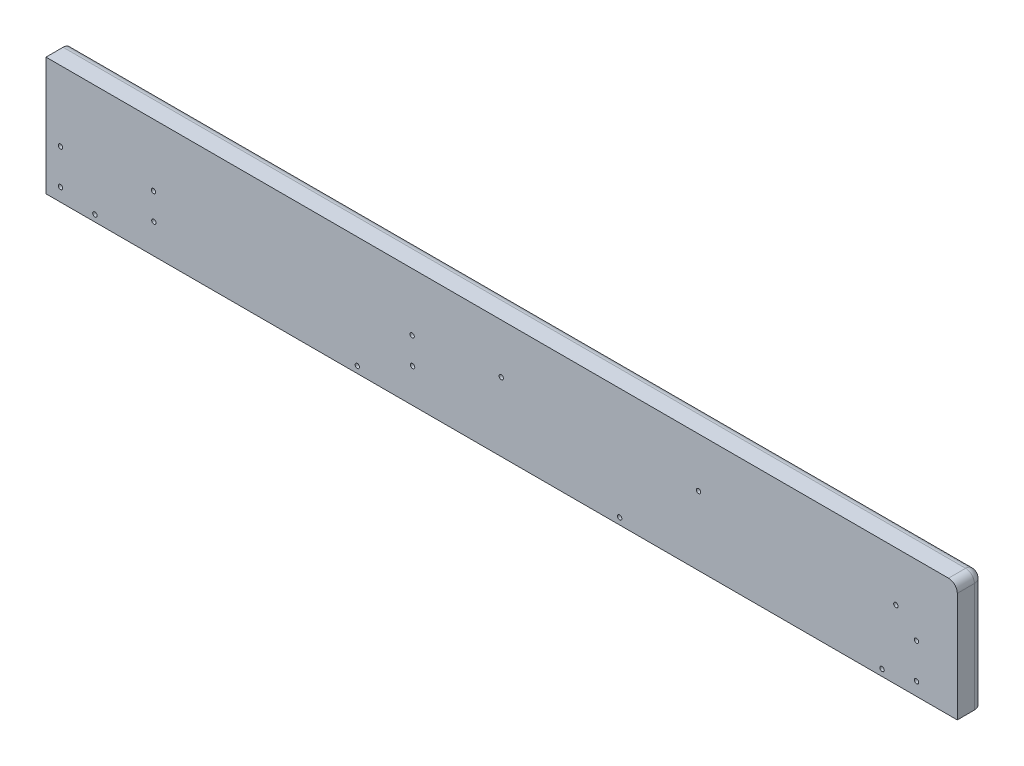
from build123d import *

# Parameters (mm, degrees)
SKETCH_1_W          = 2018
SKETCH_1_H          = 270
SKETCH_1_R          = 5
EXTRUDE_1_DEPTH     = 16
SKETCH_2_R          = 5
CUT_EXTRUDE_1_DEPTH = 1045.622898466
SKETCH_3_W          = 2018
SKETCH_3_H          = 270
EXTRUDE_2_DEPTH     = 43
FILLET_1_R          = 20
MOVE_FACE_2_BY      = 60
FILLET_2_R          = 20


with BuildPart() as part:
    # Sketch 1 → Extrude 1 (new body)
    with BuildSketch(Plane.XY):
        with Locations((0, -135)):
            Rectangle(SKETCH_1_W, SKETCH_1_H)
        with Locations((929, -113)):
            Circle(SKETCH_1_R, mode=Mode.SUBTRACT)
        with Locations((29, -113)):
            Circle(SKETCH_1_R, mode=Mode.SUBTRACT)
        with Locations((479, -113)):
            Circle(SKETCH_1_R, mode=Mode.SUBTRACT)
        with Locations((976, -160)):
            Circle(SKETCH_1_R, mode=Mode.SUBTRACT)
        with Locations((976, -240)):
            Circle(SKETCH_1_R, mode=Mode.SUBTRACT)
        with Locations((-976, -240)):
            Circle(SKETCH_1_R, mode=Mode.SUBTRACT)
        with Locations((-976, -160)):
            Circle(SKETCH_1_R, mode=Mode.SUBTRACT)
        with Locations((-897.5, -255)):
            Circle(SKETCH_1_R, mode=Mode.SUBTRACT)
        with Locations((-299.166666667, -255)):
            Circle(SKETCH_1_R, mode=Mode.SUBTRACT)
        with Locations((299.166666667, -255)):
            Circle(SKETCH_1_R, mode=Mode.SUBTRACT)
        with Locations((897.5, -255)):
            Circle(SKETCH_1_R, mode=Mode.SUBTRACT)
    extrude(amount=EXTRUDE_1_DEPTH)

    # Sketch 2 → Cut-Extrude 1 (cut, through all)
    with BuildSketch(Plane(origin=(0, 0, 0), x_dir=(-1, 0, 0), z_dir=(0, 0, -1))):
        with Locations((173.067802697, -191.991381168)):
            Circle(SKETCH_2_R)
        with Locations((174.08475185, -132)):
            Circle(SKETCH_2_R)
        with Locations((764, -142)):
            Circle(SKETCH_2_R)
        with Locations((762.983050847, -201.991381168)):
            Circle(SKETCH_2_R)
    extrude(amount=-CUT_EXTRUDE_1_DEPTH, mode=Mode.SUBTRACT)

    # Sketch 3 → Extrude 2 (add)
    with BuildSketch(Plane(origin=(0, 0, 0), x_dir=(-1, 0, 0), z_dir=(0, 0, -1))):
        with Locations((0, -135)):
            Rectangle(SKETCH_3_W, SKETCH_3_H)
    extrude(amount=EXTRUDE_2_DEPTH)

    # Fillet 1
    fillet_1_edges = [part.edges().sort_by_distance(p)[0] for p in [
        (0, 0, -43),
    ]]
    fillet(fillet_1_edges, radius=FILLET_1_R)

    # Move Face 2: a face moved outward by 60.0
    extrude(part.faces().sort_by_distance((1009, -135.707201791, -13.364377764))[0], amount=MOVE_FACE_2_BY, dir=(1, 0, 0))

    # Fillet 2
    fillet_2_edges = [part.edges().sort_by_distance(p)[0] for p in [
        (1069, -145, -43),
        (1069, -5.857864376, -37.142135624),
        (1069, 0, -3.5),
    ]]
    fillet(fillet_2_edges, radius=FILLET_2_R)


solid = part.part
